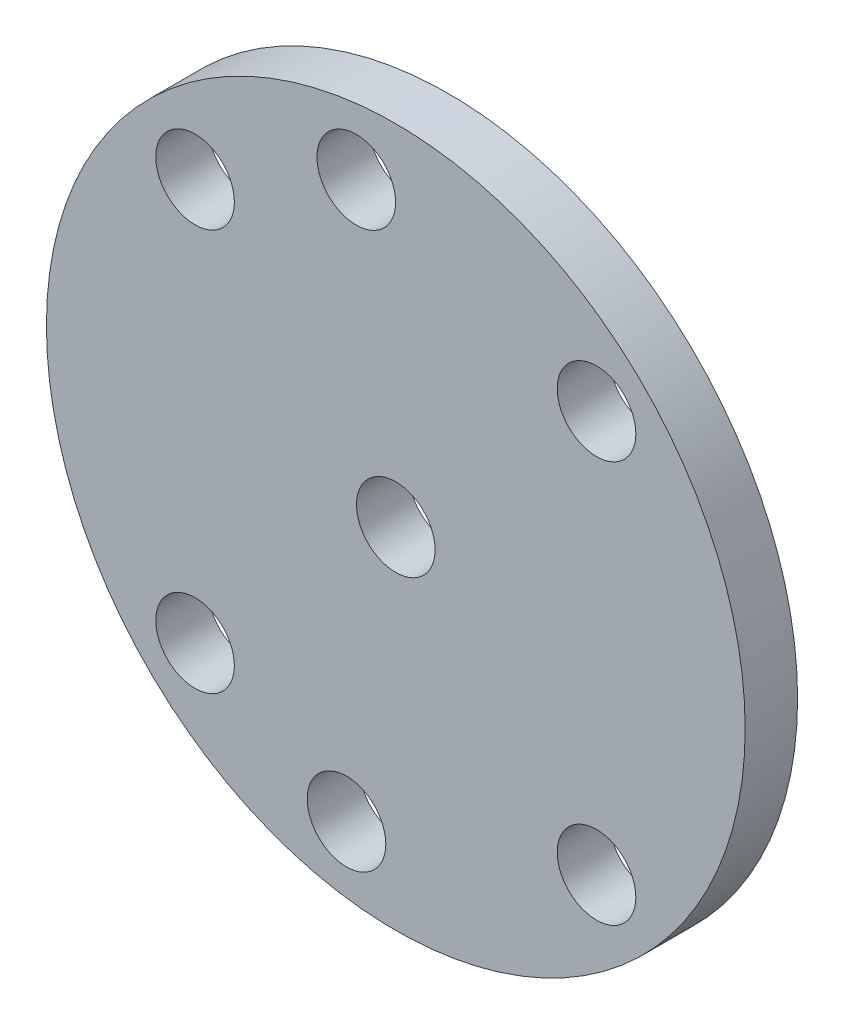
from build123d import *

# Parameters (mm, degrees)
ESQUISSE1_R      = 40
ESQUISSE1_R_2    = 4.5
EXTRUSION1_DEPTH = 6


with BuildPart() as part:
    # Esquisse1 → Extrusion1 (new body)
    with BuildSketch(Plane.XY):
        Circle(ESQUISSE1_R)
        with Locations((22.980970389, -22.980970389)):
            Circle(ESQUISSE1_R_2, mode=Mode.SUBTRACT)
        with Locations((22.980970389, 22.980970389)):
            Circle(ESQUISSE1_R_2, mode=Mode.SUBTRACT)
        with Locations((-22.980970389, 22.980970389)):
            Circle(ESQUISSE1_R_2, mode=Mode.SUBTRACT)
        with Locations((-22.980970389, -22.980970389)):
            Circle(ESQUISSE1_R_2, mode=Mode.SUBTRACT)
        with Locations((-5.643565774, -32.006251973)):
            Circle(ESQUISSE1_R_2, mode=Mode.SUBTRACT)
        with Locations((-4.523125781, 32.183712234)):
            Circle(ESQUISSE1_R_2, mode=Mode.SUBTRACT)
        Circle(ESQUISSE1_R_2, mode=Mode.SUBTRACT)
    extrude(amount=EXTRUSION1_DEPTH)


solid = part.part
